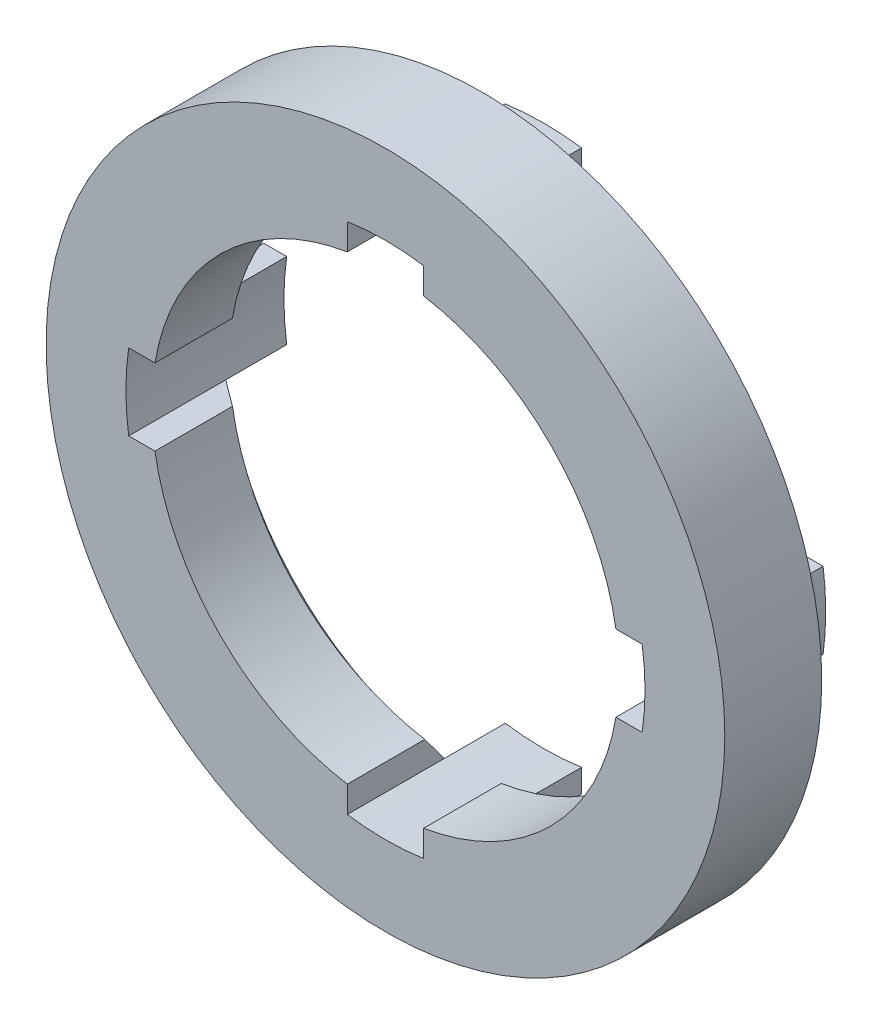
ISO-10303-21;
HEADER;
FILE_DESCRIPTION(('STEP AP214'),'2;1');
FILE_NAME('part.step','',(''),(''),'','','');
FILE_SCHEMA(('AUTOMOTIVE_DESIGN { 1 0 10303 214 1 1 1 1 }'));
ENDSEC;
DATA;
#1=APPLICATION_CONTEXT('core data for automotive mechanical design processes');
#2=APPLICATION_PROTOCOL_DEFINITION('international standard','automotive_design',2000,#1);
#3=PRODUCT_CONTEXT('',#1,'mechanical');
#4=PRODUCT('Part','Part','',(#3));
#5=PRODUCT_RELATED_PRODUCT_CATEGORY('part','',(#4));
#6=PRODUCT_DEFINITION_FORMATION('','',#4);
#7=PRODUCT_DEFINITION_CONTEXT('part definition',#1,'design');
#8=PRODUCT_DEFINITION('design','',#6,#7);
#9=PRODUCT_DEFINITION_SHAPE('','',#8);
#10=(LENGTH_UNIT() NAMED_UNIT(*) SI_UNIT(.MILLI.,.METRE.));
#11=(NAMED_UNIT(*) PLANE_ANGLE_UNIT() SI_UNIT($,.RADIAN.));
#12=(NAMED_UNIT(*) SI_UNIT($,.STERADIAN.) SOLID_ANGLE_UNIT());
#13=UNCERTAINTY_MEASURE_WITH_UNIT(LENGTH_MEASURE(1.E-05),#10,'distance_accuracy_value','');
#14=(GEOMETRIC_REPRESENTATION_CONTEXT(3) GLOBAL_UNCERTAINTY_ASSIGNED_CONTEXT((#13)) GLOBAL_UNIT_ASSIGNED_CONTEXT((#10,
#11,#12)) REPRESENTATION_CONTEXT('',''));
#15=CARTESIAN_POINT('',(0.,0.,0.));
#16=DIRECTION('',(0.,0.,1.));
#17=DIRECTION('',(1.,0.,0.));
#18=AXIS2_PLACEMENT_3D('',#15,#16,#17);
#19=CARTESIAN_POINT('',(0.,0.,0.));
#20=DIRECTION('',(0.,0.,1.));
#21=DIRECTION('',(1.,0.,0.));
#22=AXIS2_PLACEMENT_3D('',#19,#20,#21);
#23=PLANE('',#22);
#24=CARTESIAN_POINT('',(0.,0.,0.));
#25=DIRECTION('',(0.,0.,1.));
#26=DIRECTION('',(1.,0.,0.));
#27=AXIS2_PLACEMENT_3D('',#24,#25,#26);
#28=CIRCLE('',#27,22.225);
#29=CARTESIAN_POINT('',(22.225,0.,0.));
#30=VERTEX_POINT('',#29);
#31=EDGE_CURVE('E45',#30,#30,#28,.T.);
#32=ORIENTED_EDGE('',*,*,#31,.F.);
#33=EDGE_LOOP('',(#32));
#34=FACE_BOUND('',#33,.T.);
#35=DIRECTION('',(0.,-1.,0.));
#36=VECTOR('',#35,1.);
#37=CARTESIAN_POINT('',(2.50000000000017,-16.8151717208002,0.));
#38=LINE('',#37,#36);
#39=CARTESIAN_POINT('',(2.50000000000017,-16.8151717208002,0.));
#40=VERTEX_POINT('',#39);
#41=CARTESIAN_POINT('',(2.50000000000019,-18.3151717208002,0.));
#42=VERTEX_POINT('',#41);
#43=EDGE_CURVE('E932',#40,#42,#38,.T.);
#44=ORIENTED_EDGE('',*,*,#43,.F.);
#45=CARTESIAN_POINT('',(0.,0.,0.));
#46=DIRECTION('',(0.,0.,-1.));
#47=DIRECTION('',(-1.,0.,0.));
#48=AXIS2_PLACEMENT_3D('',#45,#46,#47);
#49=CIRCLE('',#48,17.);
#50=CARTESIAN_POINT('',(16.8151717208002,-2.5,0.));
#51=VERTEX_POINT('',#50);
#52=EDGE_CURVE('E527',#51,#40,#49,.T.);
#53=ORIENTED_EDGE('',*,*,#52,.F.);
#54=DIRECTION('',(-1.,0.,0.));
#55=VECTOR('',#54,1.);
#56=CARTESIAN_POINT('',(16.8151717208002,-2.5,0.));
#57=LINE('',#56,#55);
#58=CARTESIAN_POINT('',(18.3151717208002,-2.5,0.));
#59=VERTEX_POINT('',#58);
#60=EDGE_CURVE('E544',#59,#51,#57,.T.);
#61=ORIENTED_EDGE('',*,*,#60,.F.);
#62=CARTESIAN_POINT('',(0.,0.,0.));
#63=DIRECTION('',(0.,0.,-1.));
#64=DIRECTION('',(-1.,0.,0.));
#65=AXIS2_PLACEMENT_3D('',#62,#63,#64);
#66=CIRCLE('',#65,18.4850078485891);
#67=CARTESIAN_POINT('',(18.3151717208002,2.5,0.));
#68=VERTEX_POINT('',#67);
#69=EDGE_CURVE('E548',#68,#59,#66,.T.);
#70=ORIENTED_EDGE('',*,*,#69,.F.);
#71=DIRECTION('',(1.,0.,0.));
#72=VECTOR('',#71,1.);
#73=CARTESIAN_POINT('',(16.8151717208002,2.5,0.));
#74=LINE('',#73,#72);
#75=CARTESIAN_POINT('',(16.8151717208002,2.5,0.));
#76=VERTEX_POINT('',#75);
#77=EDGE_CURVE('E412',#76,#68,#74,.T.);
#78=ORIENTED_EDGE('',*,*,#77,.F.);
#79=CARTESIAN_POINT('',(2.49999999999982,16.8151717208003,0.));
#80=VERTEX_POINT('',#79);
#81=EDGE_CURVE('E39',#80,#76,#49,.T.);
#82=ORIENTED_EDGE('',*,*,#81,.F.);
#83=DIRECTION('',(0.,-1.,0.));
#84=VECTOR('',#83,1.);
#85=CARTESIAN_POINT('',(2.49999999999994,16.8151717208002,0.));
#86=LINE('',#85,#84);
#87=CARTESIAN_POINT('',(2.49999999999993,18.3151717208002,0.));
#88=VERTEX_POINT('',#87);
#89=EDGE_CURVE('E287',#88,#80,#86,.T.);
#90=ORIENTED_EDGE('',*,*,#89,.F.);
#91=CARTESIAN_POINT('',(0.,0.,0.));
#92=DIRECTION('',(0.,0.,-1.));
#93=DIRECTION('',(0.,-1.,0.));
#94=AXIS2_PLACEMENT_3D('',#91,#92,#93);
#95=CIRCLE('',#94,18.4850078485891);
#96=CARTESIAN_POINT('',(-2.50000000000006,18.3151717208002,0.));
#97=VERTEX_POINT('',#96);
#98=EDGE_CURVE('E295',#97,#88,#95,.T.);
#99=ORIENTED_EDGE('',*,*,#98,.F.);
#100=DIRECTION('',(0.,1.,0.));
#101=VECTOR('',#100,1.);
#102=CARTESIAN_POINT('',(-2.50000000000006,16.8151717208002,0.));
#103=LINE('',#102,#101);
#104=CARTESIAN_POINT('',(-2.50000000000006,16.8151717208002,0.));
#105=VERTEX_POINT('',#104);
#106=EDGE_CURVE('E282',#105,#97,#103,.T.);
#107=ORIENTED_EDGE('',*,*,#106,.F.);
#108=CARTESIAN_POINT('',(-16.8151717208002,2.5,0.));
#109=VERTEX_POINT('',#108);
#110=EDGE_CURVE('E521',#109,#105,#49,.T.);
#111=ORIENTED_EDGE('',*,*,#110,.F.);
#112=DIRECTION('',(1.,0.,0.));
#113=VECTOR('',#112,1.);
#114=CARTESIAN_POINT('',(-16.8151717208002,2.5,0.));
#115=LINE('',#114,#113);
#116=CARTESIAN_POINT('',(-18.3151717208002,2.5,0.));
#117=VERTEX_POINT('',#116);
#118=EDGE_CURVE('E263',#117,#109,#115,.T.);
#119=ORIENTED_EDGE('',*,*,#118,.F.);
#120=CARTESIAN_POINT('',(0.,0.,0.));
#121=DIRECTION('',(0.,0.,-1.));
#122=DIRECTION('',(1.,0.,0.));
#123=AXIS2_PLACEMENT_3D('',#120,#121,#122);
#124=CIRCLE('',#123,18.4850078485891);
#125=CARTESIAN_POINT('',(-18.3151717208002,-2.5,0.));
#126=VERTEX_POINT('',#125);
#127=EDGE_CURVE('E253',#126,#117,#124,.T.);
#128=ORIENTED_EDGE('',*,*,#127,.F.);
#129=DIRECTION('',(-1.,0.,0.));
#130=VECTOR('',#129,1.);
#131=CARTESIAN_POINT('',(-16.8151717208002,-2.5,0.));
#132=LINE('',#131,#130);
#133=CARTESIAN_POINT('',(-16.8151717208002,-2.5,0.));
#134=VERTEX_POINT('',#133);
#135=EDGE_CURVE('E251',#134,#126,#132,.T.);
#136=ORIENTED_EDGE('',*,*,#135,.F.);
#137=CARTESIAN_POINT('',(-2.49999999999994,-16.8151717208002,0.));
#138=VERTEX_POINT('',#137);
#139=EDGE_CURVE('E534',#138,#134,#49,.T.);
#140=ORIENTED_EDGE('',*,*,#139,.F.);
#141=DIRECTION('',(0.,1.,0.));
#142=VECTOR('',#141,1.);
#143=CARTESIAN_POINT('',(-2.49999999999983,-16.8151717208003,0.));
#144=LINE('',#143,#142);
#145=CARTESIAN_POINT('',(-2.4999999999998,-18.3151717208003,0.));
#146=VERTEX_POINT('',#145);
#147=EDGE_CURVE('E244',#146,#138,#144,.T.);
#148=ORIENTED_EDGE('',*,*,#147,.F.);
#149=CARTESIAN_POINT('',(0.,0.,0.));
#150=DIRECTION('',(0.,0.,-1.));
#151=DIRECTION('',(0.,1.,0.));
#152=AXIS2_PLACEMENT_3D('',#149,#150,#151);
#153=CIRCLE('',#152,18.4850078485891);
#154=EDGE_CURVE('E917',#42,#146,#153,.T.);
#155=ORIENTED_EDGE('',*,*,#154,.F.);
#156=EDGE_LOOP('',(#44,#53,#61,#70,#78,#82,#90,#99,#107,#111,#119,#128,#136,#140,#148,#155));
#157=FACE_BOUND('',#156,.T.);
#158=ADVANCED_FACE('F35',(#34,#157),#23,.F.);
#159=CARTESIAN_POINT('',(0.,0.,-0.00100000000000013));
#160=DIRECTION('',(0.,0.,1.));
#161=DIRECTION('',(1.,0.,0.));
#162=AXIS2_PLACEMENT_3D('',#159,#160,#161);
#163=CYLINDRICAL_SURFACE('',#162,15.3);
#164=CARTESIAN_POINT('',(0.,0.,6.35));
#165=DIRECTION('',(0.,0.,1.));
#166=DIRECTION('',(1.,0.,0.));
#167=AXIS2_PLACEMENT_3D('',#164,#165,#166);
#168=CIRCLE('',#167,15.3);
#169=CARTESIAN_POINT('',(15.0943698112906,2.5,6.35));
#170=VERTEX_POINT('',#169);
#171=CARTESIAN_POINT('',(2.49999999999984,15.0943698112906,6.35));
#172=VERTEX_POINT('',#171);
#173=EDGE_CURVE('E508',#170,#172,#168,.T.);
#174=ORIENTED_EDGE('',*,*,#173,.T.);
#175=DIRECTION('',(0.,0.,1.));
#176=VECTOR('',#175,1.);
#177=CARTESIAN_POINT('',(2.49999999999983,15.0943698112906,-0.00100000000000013));
#178=LINE('',#177,#176);
#179=CARTESIAN_POINT('',(2.49999999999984,15.0943698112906,1.27407777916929));
#180=VERTEX_POINT('',#179);
#181=EDGE_CURVE('E309',#180,#172,#178,.T.);
#182=ORIENTED_EDGE('',*,*,#181,.F.);
#183=CARTESIAN_POINT('',(0.,0.,1.27407777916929));
#184=DIRECTION('',(0.,0.,-1.));
#185=DIRECTION('',(-1.,0.,0.));
#186=AXIS2_PLACEMENT_3D('',#183,#184,#185);
#187=CIRCLE('',#186,15.3);
#188=CARTESIAN_POINT('',(15.0943698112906,2.5,1.27407777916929));
#189=VERTEX_POINT('',#188);
#190=EDGE_CURVE('E516',#180,#189,#187,.T.);
#191=ORIENTED_EDGE('',*,*,#190,.T.);
#192=DIRECTION('',(0.,0.,1.));
#193=VECTOR('',#192,1.);
#194=CARTESIAN_POINT('',(15.0943698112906,2.5,-0.00100000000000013));
#195=LINE('',#194,#193);
#196=EDGE_CURVE('E335',#170,#189,#195,.F.);
#197=ORIENTED_EDGE('',*,*,#196,.F.);
#198=EDGE_LOOP('',(#174,#182,#191,#197));
#199=FACE_BOUND('',#198,.T.);
#200=ADVANCED_FACE('F613',(#199),#163,.F.);
#201=CARTESIAN_POINT('',(0.,0.,0.));
#202=DIRECTION('',(0.,0.,-1.));
#203=DIRECTION('',(-1.,0.,0.));
#204=AXIS2_PLACEMENT_3D('',#201,#202,#203);
#205=CONICAL_SURFACE('',#204,17.,0.92764249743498);
#206=ORIENTED_EDGE('',*,*,#190,.F.);
#207=CARTESIAN_POINT('',(2.4999999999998,18.6606311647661,-1.36952213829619));
#208=CARTESIAN_POINT('',(2.49999999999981,18.1151663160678,-0.964351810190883));
#209=CARTESIAN_POINT('',(2.49999999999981,17.5695632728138,-0.55936728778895));
#210=CARTESIAN_POINT('',(2.49999999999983,16.4779615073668,0.250065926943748));
#211=CARTESIAN_POINT('',(2.49999999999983,15.9319627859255,0.654514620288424));
#212=CARTESIAN_POINT('',(2.49999999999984,14.8394477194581,1.46271393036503));
#213=CARTESIAN_POINT('',(2.49999999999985,14.292931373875,1.86646454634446));
#214=CARTESIAN_POINT('',(2.49999999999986,13.1991514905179,2.67295442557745));
#215=CARTESIAN_POINT('',(2.49999999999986,12.6518879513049,3.07569368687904));
#216=CARTESIAN_POINT('',(2.49999999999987,12.1041367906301,3.47777007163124));
#217=B_SPLINE_CURVE_WITH_KNOTS('',3,(#207,#208,#209,#210,#211,#212,#213,#214,#215,#216),
.UNSPECIFIED.,.F.,.F.,(4,2,2,2,4),(0.,2.03844417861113,4.07688449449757,6.1153270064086,
8.1537734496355),.UNSPECIFIED.);
#218=EDGE_CURVE('E311',#80,#180,#217,.T.);
#219=ORIENTED_EDGE('',*,*,#218,.F.);
#220=ORIENTED_EDGE('',*,*,#81,.T.);
#221=CARTESIAN_POINT('',(12.10413679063,2.5,3.47777007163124));
#222=CARTESIAN_POINT('',(12.6518879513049,2.5,3.07569368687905));
#223=CARTESIAN_POINT('',(13.1991514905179,2.5,2.67295442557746));
#224=CARTESIAN_POINT('',(14.2929313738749,2.5,1.86646454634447));
#225=CARTESIAN_POINT('',(14.8394477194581,2.5,1.46271393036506));
#226=CARTESIAN_POINT('',(15.9319627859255,2.5,0.654514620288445));
#227=CARTESIAN_POINT('',(16.4779615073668,2.5,0.250065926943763));
#228=CARTESIAN_POINT('',(17.5695632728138,2.5,-0.559367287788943));
#229=CARTESIAN_POINT('',(18.1151663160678,2.5,-0.964351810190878));
#230=CARTESIAN_POINT('',(18.6606311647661,2.5,-1.36952213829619));
#231=B_SPLINE_CURVE_WITH_KNOTS('',3,(#221,#222,#223,#224,#225,#226,#227,#228,#229,#230),
.UNSPECIFIED.,.F.,.F.,(4,2,2,2,4),(0.,2.03844644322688,4.07688895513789,6.11532927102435,
8.1537734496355),.UNSPECIFIED.);
#232=EDGE_CURVE('E385',#189,#76,#231,.T.);
#233=ORIENTED_EDGE('',*,*,#232,.F.);
#234=EDGE_LOOP('',(#206,#219,#220,#233));
#235=FACE_BOUND('',#234,.T.);
#236=ADVANCED_FACE('F591',(#235),#205,.F.);
#237=CARTESIAN_POINT('',(2.50000000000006,-15.0943698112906,6.35));
#238=VERTEX_POINT('',#237);
#239=CARTESIAN_POINT('',(15.0943698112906,-2.5,6.35));
#240=VERTEX_POINT('',#239);
#241=EDGE_CURVE('E502',#238,#240,#168,.T.);
#242=ORIENTED_EDGE('',*,*,#241,.T.);
#243=DIRECTION('',(0.,0.,1.));
#244=VECTOR('',#243,1.);
#245=CARTESIAN_POINT('',(15.0943698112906,-2.49999999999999,-0.00100000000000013));
#246=LINE('',#245,#244);
#247=CARTESIAN_POINT('',(15.0943698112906,-2.5,1.27407777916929));
#248=VERTEX_POINT('',#247);
#249=EDGE_CURVE('E596',#248,#240,#246,.T.);
#250=ORIENTED_EDGE('',*,*,#249,.F.);
#251=CARTESIAN_POINT('',(2.50000000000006,-15.0943698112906,1.27407777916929));
#252=VERTEX_POINT('',#251);
#253=EDGE_CURVE('E61',#248,#252,#187,.T.);
#254=ORIENTED_EDGE('',*,*,#253,.T.);
#255=DIRECTION('',(0.,0.,1.));
#256=VECTOR('',#255,1.);
#257=CARTESIAN_POINT('',(2.50000000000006,-15.0943698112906,-0.00100000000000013));
#258=LINE('',#257,#256);
#259=EDGE_CURVE('E386',#238,#252,#258,.F.);
#260=ORIENTED_EDGE('',*,*,#259,.F.);
#261=EDGE_LOOP('',(#242,#250,#254,#260));
#262=FACE_BOUND('',#261,.T.);
#263=ADVANCED_FACE('F603',(#262),#163,.F.);
#264=ORIENTED_EDGE('',*,*,#253,.F.);
#265=CARTESIAN_POINT('',(18.6606311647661,-2.5,-1.36952213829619));
#266=CARTESIAN_POINT('',(18.1151663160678,-2.5,-0.964351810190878));
#267=CARTESIAN_POINT('',(17.5695632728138,-2.5,-0.559367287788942));
#268=CARTESIAN_POINT('',(16.4779615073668,-2.5,0.250065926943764));
#269=CARTESIAN_POINT('',(15.9319627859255,-2.5,0.654514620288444));
#270=CARTESIAN_POINT('',(14.8394477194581,-2.5,1.46271393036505));
#271=CARTESIAN_POINT('',(14.2929313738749,-2.5,1.86646454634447));
#272=CARTESIAN_POINT('',(13.1991514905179,-2.5,2.67295442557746));
#273=CARTESIAN_POINT('',(12.6518879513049,-2.5,3.07569368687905));
#274=CARTESIAN_POINT('',(12.10413679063,-2.5,3.47777007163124));
#275=B_SPLINE_CURVE_WITH_KNOTS('',3,(#265,#266,#267,#268,#269,#270,#271,#272,#273,#274),
.UNSPECIFIED.,.F.,.F.,(4,2,2,2,4),(0.,2.03844417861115,4.07688449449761,6.11532700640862,
8.15377344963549),.UNSPECIFIED.);
#276=EDGE_CURVE('E369',#51,#248,#275,.T.);
#277=ORIENTED_EDGE('',*,*,#276,.F.);
#278=ORIENTED_EDGE('',*,*,#52,.T.);
#279=CARTESIAN_POINT('',(2.50000000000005,-13.2452231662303,2.63877053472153));
#280=CARTESIAN_POINT('',(2.50000000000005,-13.7923305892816,2.23582019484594));
#281=CARTESIAN_POINT('',(2.50000000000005,-14.3390582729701,1.83235507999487));
#282=CARTESIAN_POINT('',(2.50000000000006,-15.4319229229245,1.02462690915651));
#283=CARTESIAN_POINT('',(2.50000000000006,-15.978059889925,0.620363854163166));
#284=CARTESIAN_POINT('',(2.50000000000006,-17.0699128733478,-0.188729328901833));
#285=CARTESIAN_POINT('',(2.50000000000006,-17.6156288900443,-0.593559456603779));
#286=CARTESIAN_POINT('',(2.50000000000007,-18.7067341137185,-1.40366131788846));
#287=CARTESIAN_POINT('',(2.50000000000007,-19.2521233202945,-1.80893305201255));
#288=CARTESIAN_POINT('',(2.50000000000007,-19.797395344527,-2.21436222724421));
#289=B_SPLINE_CURVE_WITH_KNOTS('',3,(#279,#280,#281,#282,#283,#284,#285,#286,#287,#288),
.UNSPECIFIED.,.F.,.F.,(4,2,2,2,4),(0.,2.03844439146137,4.07688624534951,6.11532677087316,
8.15376979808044),.UNSPECIFIED.);
#290=EDGE_CURVE('E406',#252,#40,#289,.T.);
#291=ORIENTED_EDGE('',*,*,#290,.F.);
#292=EDGE_LOOP('',(#264,#277,#278,#291));
#293=FACE_BOUND('',#292,.T.);
#294=ADVANCED_FACE('F606',(#293),#205,.F.);
#295=CARTESIAN_POINT('',(-15.0943698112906,-2.5,6.35));
#296=VERTEX_POINT('',#295);
#297=CARTESIAN_POINT('',(-2.49999999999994,-15.0943698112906,6.35));
#298=VERTEX_POINT('',#297);
#299=EDGE_CURVE('E496',#296,#298,#168,.T.);
#300=ORIENTED_EDGE('',*,*,#299,.T.);
#301=DIRECTION('',(0.,0.,1.));
#302=VECTOR('',#301,1.);
#303=CARTESIAN_POINT('',(-2.49999999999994,-15.0943698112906,-0.00100000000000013));
#304=LINE('',#303,#302);
#305=CARTESIAN_POINT('',(-2.49999999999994,-15.0943698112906,1.27407777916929));
#306=VERTEX_POINT('',#305);
#307=EDGE_CURVE('E388',#306,#298,#304,.T.);
#308=ORIENTED_EDGE('',*,*,#307,.F.);
#309=CARTESIAN_POINT('',(-15.0943698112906,-2.5,1.27407777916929));
#310=VERTEX_POINT('',#309);
#311=EDGE_CURVE('E518',#306,#310,#187,.T.);
#312=ORIENTED_EDGE('',*,*,#311,.T.);
#313=DIRECTION('',(0.,0.,1.));
#314=VECTOR('',#313,1.);
#315=CARTESIAN_POINT('',(-15.0943698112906,-2.5,-0.00100000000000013));
#316=LINE('',#315,#314);
#317=EDGE_CURVE('E560',#296,#310,#316,.F.);
#318=ORIENTED_EDGE('',*,*,#317,.F.);
#319=EDGE_LOOP('',(#300,#308,#312,#318));
#320=FACE_BOUND('',#319,.T.);
#321=ADVANCED_FACE('F660',(#320),#163,.F.);
#322=ORIENTED_EDGE('',*,*,#311,.F.);
#323=CARTESIAN_POINT('',(-2.49999999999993,-19.797395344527,-2.21436222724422));
#324=CARTESIAN_POINT('',(-2.49999999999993,-19.2521233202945,-1.80893305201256));
#325=CARTESIAN_POINT('',(-2.49999999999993,-18.7067341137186,-1.40366131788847));
#326=CARTESIAN_POINT('',(-2.49999999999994,-17.6156288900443,-0.593559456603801));
#327=CARTESIAN_POINT('',(-2.49999999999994,-17.0699128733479,-0.18872932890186));
#328=CARTESIAN_POINT('',(-2.49999999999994,-15.9780598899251,0.620363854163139));
#329=CARTESIAN_POINT('',(-2.49999999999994,-15.4319229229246,1.02462690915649));
#330=CARTESIAN_POINT('',(-2.49999999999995,-14.3390582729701,1.83235507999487));
#331=CARTESIAN_POINT('',(-2.49999999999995,-13.7923305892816,2.23582019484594));
#332=CARTESIAN_POINT('',(-2.49999999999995,-13.2452231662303,2.63877053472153));
#333=B_SPLINE_CURVE_WITH_KNOTS('',3,(#323,#324,#325,#326,#327,#328,#329,#330,#331,#332),
.UNSPECIFIED.,.F.,.F.,(4,2,2,2,4),(0.,2.03844302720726,4.0768835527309,6.11532540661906,
8.15376979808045),.UNSPECIFIED.);
#334=EDGE_CURVE('E390',#138,#306,#333,.T.);
#335=ORIENTED_EDGE('',*,*,#334,.F.);
#336=ORIENTED_EDGE('',*,*,#139,.T.);
#337=CARTESIAN_POINT('',(-13.245231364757,-2.5,2.63876449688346));
#338=CARTESIAN_POINT('',(-13.7923344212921,-2.5,2.23581736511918));
#339=CARTESIAN_POINT('',(-14.3390577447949,-2.5,1.83235546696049));
#340=CARTESIAN_POINT('',(-15.4319136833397,-2.5,1.02463374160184));
#341=CARTESIAN_POINT('',(-15.9780462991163,-2.5,0.620373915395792));
#342=CARTESIAN_POINT('',(-17.0698905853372,-2.5,-0.188712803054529));
#343=CARTESIAN_POINT('',(-17.6156022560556,-2.5,-0.593539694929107));
#344=CARTESIAN_POINT('',(-18.7066987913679,-2.5,-1.40363507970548));
#345=CARTESIAN_POINT('',(-19.2520836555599,-2.5,-1.80890357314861));
#346=CARTESIAN_POINT('',(-19.7973513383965,-2.5,-2.21432950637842));
#347=B_SPLINE_CURVE_WITH_KNOTS('',3,(#337,#338,#339,#340,#341,#342,#343,#344,#345,#346),
.UNSPECIFIED.,.F.,.F.,(4,2,2,2,4),(0.,2.03842813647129,4.07685373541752,6.11527800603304,
8.15370477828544),.UNSPECIFIED.);
#348=EDGE_CURVE('E452',#310,#134,#347,.T.);
#349=ORIENTED_EDGE('',*,*,#348,.F.);
#350=EDGE_LOOP('',(#322,#335,#336,#349));
#351=FACE_BOUND('',#350,.T.);
#352=ADVANCED_FACE('F663',(#351),#205,.F.);
#353=CARTESIAN_POINT('',(0.,0.,6.35));
#354=DIRECTION('',(0.,0.,-1.));
#355=DIRECTION('',(-1.,0.,0.));
#356=AXIS2_PLACEMENT_3D('',#353,#354,#355);
#357=CYLINDRICAL_SURFACE('',#356,22.225);
#358=CARTESIAN_POINT('',(0.,0.,6.35));
#359=DIRECTION('',(0.,0.,1.));
#360=DIRECTION('',(1.,0.,0.));
#361=AXIS2_PLACEMENT_3D('',#358,#359,#360);
#362=CIRCLE('',#361,22.225);
#363=CARTESIAN_POINT('',(22.225,0.,6.35));
#364=VERTEX_POINT('',#363);
#365=EDGE_CURVE('E11',#364,#364,#362,.T.);
#366=ORIENTED_EDGE('',*,*,#365,.F.);
#367=EDGE_LOOP('',(#366));
#368=FACE_BOUND('',#367,.T.);
#369=ORIENTED_EDGE('',*,*,#31,.T.);
#370=EDGE_LOOP('',(#369));
#371=FACE_BOUND('',#370,.T.);
#372=ADVANCED_FACE('F37',(#368,#371),#357,.T.);
#373=CARTESIAN_POINT('',(0.,0.,6.35));
#374=DIRECTION('',(0.,0.,1.));
#375=DIRECTION('',(1.,0.,0.));
#376=AXIS2_PLACEMENT_3D('',#373,#374,#375);
#377=PLANE('',#376);
#378=DIRECTION('',(0.,1.,0.));
#379=VECTOR('',#378,1.);
#380=CARTESIAN_POINT('',(2.49999999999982,16.8151717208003,6.35));
#381=LINE('',#380,#379);
#382=CARTESIAN_POINT('',(2.49999999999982,16.8151717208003,6.35));
#383=VERTEX_POINT('',#382);
#384=EDGE_CURVE('E611',#172,#383,#381,.T.);
#385=ORIENTED_EDGE('',*,*,#384,.F.);
#386=ORIENTED_EDGE('',*,*,#173,.F.);
#387=DIRECTION('',(-1.,0.,0.));
#388=VECTOR('',#387,1.);
#389=CARTESIAN_POINT('',(16.8151717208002,2.5,6.35));
#390=LINE('',#389,#388);
#391=CARTESIAN_POINT('',(16.8151717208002,2.5,6.35));
#392=VERTEX_POINT('',#391);
#393=EDGE_CURVE('E373',#392,#170,#390,.T.);
#394=ORIENTED_EDGE('',*,*,#393,.F.);
#395=CARTESIAN_POINT('',(0.,0.,6.35));
#396=DIRECTION('',(0.,0.,1.));
#397=DIRECTION('',(-1.,0.,0.));
#398=AXIS2_PLACEMENT_3D('',#395,#396,#397);
#399=CIRCLE('',#398,17.);
#400=CARTESIAN_POINT('',(16.8151717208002,-2.5,6.35));
#401=VERTEX_POINT('',#400);
#402=EDGE_CURVE('E370',#401,#392,#399,.T.);
#403=ORIENTED_EDGE('',*,*,#402,.F.);
#404=DIRECTION('',(1.,0.,0.));
#405=VECTOR('',#404,1.);
#406=CARTESIAN_POINT('',(16.8151717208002,-2.5,6.35));
#407=LINE('',#406,#405);
#408=EDGE_CURVE('E375',#240,#401,#407,.T.);
#409=ORIENTED_EDGE('',*,*,#408,.F.);
#410=ORIENTED_EDGE('',*,*,#241,.F.);
#411=DIRECTION('',(0.,1.,0.));
#412=VECTOR('',#411,1.);
#413=CARTESIAN_POINT('',(2.50000000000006,-16.8151717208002,6.35));
#414=LINE('',#413,#412);
#415=CARTESIAN_POINT('',(2.50000000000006,-16.8151717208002,6.35));
#416=VERTEX_POINT('',#415);
#417=EDGE_CURVE('E608',#416,#238,#414,.T.);
#418=ORIENTED_EDGE('',*,*,#417,.F.);
#419=CARTESIAN_POINT('',(0.,0.,6.35));
#420=DIRECTION('',(0.,0.,1.));
#421=DIRECTION('',(0.,1.,0.));
#422=AXIS2_PLACEMENT_3D('',#419,#420,#421);
#423=CIRCLE('',#422,17.);
#424=CARTESIAN_POINT('',(-2.49999999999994,-16.8151717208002,6.35));
#425=VERTEX_POINT('',#424);
#426=EDGE_CURVE('E397',#425,#416,#423,.T.);
#427=ORIENTED_EDGE('',*,*,#426,.F.);
#428=DIRECTION('',(0.,-1.,0.));
#429=VECTOR('',#428,1.);
#430=CARTESIAN_POINT('',(-2.49999999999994,-16.8151717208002,6.35));
#431=LINE('',#430,#429);
#432=EDGE_CURVE('E499',#298,#425,#431,.T.);
#433=ORIENTED_EDGE('',*,*,#432,.F.);
#434=ORIENTED_EDGE('',*,*,#299,.F.);
#435=DIRECTION('',(1.,0.,0.));
#436=VECTOR('',#435,1.);
#437=CARTESIAN_POINT('',(-16.8151717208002,-2.5,6.35));
#438=LINE('',#437,#436);
#439=CARTESIAN_POINT('',(-16.8151717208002,-2.5,6.35));
#440=VERTEX_POINT('',#439);
#441=EDGE_CURVE('E469',#440,#296,#438,.T.);
#442=ORIENTED_EDGE('',*,*,#441,.F.);
#443=CARTESIAN_POINT('',(0.,0.,6.35));
#444=DIRECTION('',(0.,0.,1.));
#445=DIRECTION('',(1.,0.,0.));
#446=AXIS2_PLACEMENT_3D('',#443,#444,#445);
#447=CIRCLE('',#446,17.);
#448=CARTESIAN_POINT('',(-16.8151717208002,2.5,6.35));
#449=VERTEX_POINT('',#448);
#450=EDGE_CURVE('E464',#449,#440,#447,.T.);
#451=ORIENTED_EDGE('',*,*,#450,.F.);
#452=DIRECTION('',(-1.,0.,0.));
#453=VECTOR('',#452,1.);
#454=CARTESIAN_POINT('',(-16.8151717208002,2.5,6.35));
#455=LINE('',#454,#453);
#456=CARTESIAN_POINT('',(-15.0943698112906,2.5,6.35));
#457=VERTEX_POINT('',#456);
#458=EDGE_CURVE('E471',#457,#449,#455,.T.);
#459=ORIENTED_EDGE('',*,*,#458,.F.);
#460=CARTESIAN_POINT('',(-2.50000000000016,15.0943698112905,6.35));
#461=VERTEX_POINT('',#460);
#462=EDGE_CURVE('E504',#461,#457,#168,.T.);
#463=ORIENTED_EDGE('',*,*,#462,.F.);
#464=DIRECTION('',(0.,-1.,0.));
#465=VECTOR('',#464,1.);
#466=CARTESIAN_POINT('',(-2.50000000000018,16.8151717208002,6.35));
#467=LINE('',#466,#465);
#468=CARTESIAN_POINT('',(-2.50000000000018,16.8151717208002,6.35));
#469=VERTEX_POINT('',#468);
#470=EDGE_CURVE('E618',#469,#461,#467,.T.);
#471=ORIENTED_EDGE('',*,*,#470,.F.);
#472=CARTESIAN_POINT('',(0.,0.,6.35));
#473=DIRECTION('',(0.,0.,1.));
#474=DIRECTION('',(0.,-1.,0.));
#475=AXIS2_PLACEMENT_3D('',#472,#473,#474);
#476=CIRCLE('',#475,17.);
#477=EDGE_CURVE('E318',#383,#469,#476,.T.);
#478=ORIENTED_EDGE('',*,*,#477,.F.);
#479=EDGE_LOOP('',(#385,#386,#394,#403,#409,#410,#418,#427,#433,#434,#442,#451,#459,#463,#471,#478));
#480=FACE_BOUND('',#479,.T.);
#481=ORIENTED_EDGE('',*,*,#365,.T.);
#482=EDGE_LOOP('',(#481));
#483=FACE_BOUND('',#482,.T.);
#484=ADVANCED_FACE('F492',(#480,#483),#377,.T.);
#485=CARTESIAN_POINT('',(-15.0943698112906,2.5,1.27407777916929));
#486=VERTEX_POINT('',#485);
#487=CARTESIAN_POINT('',(-2.50000000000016,15.0943698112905,1.27407777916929));
#488=VERTEX_POINT('',#487);
#489=EDGE_CURVE('E509',#486,#488,#187,.T.);
#490=ORIENTED_EDGE('',*,*,#489,.T.);
#491=DIRECTION('',(0.,0.,1.));
#492=VECTOR('',#491,1.);
#493=CARTESIAN_POINT('',(-2.50000000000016,15.0943698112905,-0.00100000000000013));
#494=LINE('',#493,#492);
#495=EDGE_CURVE('E53',#461,#488,#494,.F.);
#496=ORIENTED_EDGE('',*,*,#495,.F.);
#497=ORIENTED_EDGE('',*,*,#462,.T.);
#498=DIRECTION('',(0.,0.,1.));
#499=VECTOR('',#498,1.);
#500=CARTESIAN_POINT('',(-15.0943698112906,2.49999999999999,-0.00100000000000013));
#501=LINE('',#500,#499);
#502=EDGE_CURVE('E465',#486,#457,#501,.T.);
#503=ORIENTED_EDGE('',*,*,#502,.F.);
#504=EDGE_LOOP('',(#490,#496,#497,#503));
#505=FACE_BOUND('',#504,.T.);
#506=ADVANCED_FACE('F623',(#505),#163,.F.);
#507=ORIENTED_EDGE('',*,*,#110,.T.);
#508=CARTESIAN_POINT('',(-2.50000000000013,12.10413679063,3.47777007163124));
#509=CARTESIAN_POINT('',(-2.50000000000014,12.6518879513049,3.07569368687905));
#510=CARTESIAN_POINT('',(-2.50000000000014,13.1991514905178,2.67295442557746));
#511=CARTESIAN_POINT('',(-2.50000000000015,14.2929313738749,1.86646454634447));
#512=CARTESIAN_POINT('',(-2.50000000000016,14.8394477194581,1.46271393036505));
#513=CARTESIAN_POINT('',(-2.50000000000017,15.9319627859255,0.654514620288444));
#514=CARTESIAN_POINT('',(-2.50000000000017,16.4779615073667,0.250065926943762));
#515=CARTESIAN_POINT('',(-2.50000000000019,17.5695632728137,-0.559367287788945));
#516=CARTESIAN_POINT('',(-2.50000000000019,18.1151663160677,-0.96435181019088));
#517=CARTESIAN_POINT('',(-2.5000000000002,18.6606311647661,-1.36952213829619));
#518=B_SPLINE_CURVE_WITH_KNOTS('',3,(#508,#509,#510,#511,#512,#513,#514,#515,#516,#517),
.UNSPECIFIED.,.F.,.F.,(4,2,2,2,4),(0.,2.03844644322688,4.07688895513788,6.11532927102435,
8.1537734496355),.UNSPECIFIED.);
#519=EDGE_CURVE('E329',#488,#105,#518,.T.);
#520=ORIENTED_EDGE('',*,*,#519,.F.);
#521=ORIENTED_EDGE('',*,*,#489,.F.);
#522=CARTESIAN_POINT('',(-19.7973513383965,2.5,-2.21432950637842));
#523=CARTESIAN_POINT('',(-19.2520836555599,2.5,-1.80890357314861));
#524=CARTESIAN_POINT('',(-18.7066987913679,2.5,-1.40363507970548));
#525=CARTESIAN_POINT('',(-17.6156022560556,2.5,-0.593539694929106));
#526=CARTESIAN_POINT('',(-17.0698905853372,2.5,-0.188712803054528));
#527=CARTESIAN_POINT('',(-15.9780462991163,2.5,0.620373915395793));
#528=CARTESIAN_POINT('',(-15.4319136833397,2.5,1.02463374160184));
#529=CARTESIAN_POINT('',(-14.3390577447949,2.5,1.83235546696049));
#530=CARTESIAN_POINT('',(-13.7923344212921,2.5,2.23581736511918));
#531=CARTESIAN_POINT('',(-13.245231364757,2.5,2.63876449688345));
#532=B_SPLINE_CURVE_WITH_KNOTS('',3,(#522,#523,#524,#525,#526,#527,#528,#529,#530,#531),
.UNSPECIFIED.,.F.,.F.,(4,2,2,2,4),(0.,2.0384267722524,4.07685104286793,6.11527664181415,
8.15370477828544),.UNSPECIFIED.);
#533=EDGE_CURVE('E458',#109,#486,#532,.T.);
#534=ORIENTED_EDGE('',*,*,#533,.F.);
#535=EDGE_LOOP('',(#507,#520,#521,#534));
#536=FACE_BOUND('',#535,.T.);
#537=ADVANCED_FACE('F624',(#536),#205,.F.);
#538=CARTESIAN_POINT('',(0.,0.,-0.00100000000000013));
#539=DIRECTION('',(0.,0.,1.));
#540=DIRECTION('',(1.,0.,0.));
#541=AXIS2_PLACEMENT_3D('',#538,#539,#540);
#542=CYLINDRICAL_SURFACE('',#541,17.);
#543=DIRECTION('',(0.,0.,1.));
#544=VECTOR('',#543,1.);
#545=CARTESIAN_POINT('',(-16.8151717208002,-2.5,-0.00100000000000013));
#546=LINE('',#545,#544);
#547=EDGE_CURVE('E474',#134,#440,#546,.T.);
#548=ORIENTED_EDGE('',*,*,#547,.F.);
#549=DIRECTION('',(0.,0.,1.));
#550=VECTOR('',#549,1.);
#551=CARTESIAN_POINT('',(-16.8151717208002,-2.5,-4.));
#552=LINE('',#551,#550);
#553=CARTESIAN_POINT('',(-16.8151717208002,-2.5,-4.));
#554=VERTEX_POINT('',#553);
#555=EDGE_CURVE('E280',#554,#134,#552,.T.);
#556=ORIENTED_EDGE('',*,*,#555,.F.);
#557=CARTESIAN_POINT('',(0.,0.,-4.));
#558=DIRECTION('',(0.,0.,1.));
#559=DIRECTION('',(1.,0.,0.));
#560=AXIS2_PLACEMENT_3D('',#557,#558,#559);
#561=CIRCLE('',#560,17.);
#562=CARTESIAN_POINT('',(-16.8151717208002,2.5,-4.));
#563=VERTEX_POINT('',#562);
#564=EDGE_CURVE('E259',#563,#554,#561,.T.);
#565=ORIENTED_EDGE('',*,*,#564,.F.);
#566=DIRECTION('',(0.,0.,1.));
#567=VECTOR('',#566,1.);
#568=CARTESIAN_POINT('',(-16.8151717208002,2.5,-4.));
#569=LINE('',#568,#567);
#570=EDGE_CURVE('E268',#563,#109,#569,.T.);
#571=ORIENTED_EDGE('',*,*,#570,.T.);
#572=DIRECTION('',(0.,0.,1.));
#573=VECTOR('',#572,1.);
#574=CARTESIAN_POINT('',(-16.8151717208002,2.5,-0.00100000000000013));
#575=LINE('',#574,#573);
#576=EDGE_CURVE('E475',#109,#449,#575,.T.);
#577=ORIENTED_EDGE('',*,*,#576,.T.);
#578=ORIENTED_EDGE('',*,*,#450,.T.);
#579=EDGE_LOOP('',(#548,#556,#565,#571,#577,#578));
#580=FACE_BOUND('',#579,.T.);
#581=ADVANCED_FACE('F486',(#580),#542,.F.);
#582=CARTESIAN_POINT('',(-16.8151717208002,2.5,-0.00100000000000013));
#583=DIRECTION('',(0.,1.,0.));
#584=DIRECTION('',(0.,0.,1.));
#585=AXIS2_PLACEMENT_3D('',#582,#583,#584);
#586=PLANE('',#585);
#587=ORIENTED_EDGE('',*,*,#533,.T.);
#588=ORIENTED_EDGE('',*,*,#502,.T.);
#589=ORIENTED_EDGE('',*,*,#458,.T.);
#590=ORIENTED_EDGE('',*,*,#576,.F.);
#591=EDGE_LOOP('',(#587,#588,#589,#590));
#592=FACE_BOUND('',#591,.T.);
#593=ADVANCED_FACE('F447',(#592),#586,.F.);
#594=CARTESIAN_POINT('',(-16.8151717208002,-2.5,-0.00100000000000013));
#595=DIRECTION('',(0.,-1.,0.));
#596=DIRECTION('',(0.,0.,-1.));
#597=AXIS2_PLACEMENT_3D('',#594,#595,#596);
#598=PLANE('',#597);
#599=ORIENTED_EDGE('',*,*,#348,.T.);
#600=ORIENTED_EDGE('',*,*,#547,.T.);
#601=ORIENTED_EDGE('',*,*,#441,.T.);
#602=ORIENTED_EDGE('',*,*,#317,.T.);
#603=EDGE_LOOP('',(#599,#600,#601,#602));
#604=FACE_BOUND('',#603,.T.);
#605=ADVANCED_FACE('F443',(#604),#598,.F.);
#606=CARTESIAN_POINT('',(0.,0.,-4.));
#607=DIRECTION('',(0.,0.,1.));
#608=DIRECTION('',(1.,0.,0.));
#609=AXIS2_PLACEMENT_3D('',#606,#607,#608);
#610=CYLINDRICAL_SURFACE('',#609,17.);
#611=DIRECTION('',(0.,0.,1.));
#612=VECTOR('',#611,1.);
#613=CARTESIAN_POINT('',(16.8151717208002,-2.5,-4.));
#614=LINE('',#613,#612);
#615=CARTESIAN_POINT('',(16.8151717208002,-2.5,-4.));
#616=VERTEX_POINT('',#615);
#617=EDGE_CURVE('E539',#616,#51,#614,.T.);
#618=ORIENTED_EDGE('',*,*,#617,.T.);
#619=DIRECTION('',(0.,0.,1.));
#620=VECTOR('',#619,1.);
#621=CARTESIAN_POINT('',(16.8151717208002,-2.5,-4.001025));
#622=LINE('',#621,#620);
#623=EDGE_CURVE('E383',#51,#401,#622,.T.);
#624=ORIENTED_EDGE('',*,*,#623,.T.);
#625=ORIENTED_EDGE('',*,*,#402,.T.);
#626=DIRECTION('',(0.,0.,1.));
#627=VECTOR('',#626,1.);
#628=CARTESIAN_POINT('',(16.8151717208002,2.5,-4.001025));
#629=LINE('',#628,#627);
#630=EDGE_CURVE('E378',#76,#392,#629,.T.);
#631=ORIENTED_EDGE('',*,*,#630,.F.);
#632=DIRECTION('',(0.,0.,1.));
#633=VECTOR('',#632,1.);
#634=CARTESIAN_POINT('',(16.8151717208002,2.5,-4.));
#635=LINE('',#634,#633);
#636=CARTESIAN_POINT('',(16.8151717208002,2.5,-4.));
#637=VERTEX_POINT('',#636);
#638=EDGE_CURVE('E559',#637,#76,#635,.T.);
#639=ORIENTED_EDGE('',*,*,#638,.F.);
#640=CARTESIAN_POINT('',(0.,0.,-4.));
#641=DIRECTION('',(0.,0.,1.));
#642=DIRECTION('',(-1.,0.,0.));
#643=AXIS2_PLACEMENT_3D('',#640,#641,#642);
#644=CIRCLE('',#643,17.);
#645=EDGE_CURVE('E415',#616,#637,#644,.T.);
#646=ORIENTED_EDGE('',*,*,#645,.F.);
#647=EDGE_LOOP('',(#618,#624,#625,#631,#639,#646));
#648=FACE_BOUND('',#647,.T.);
#649=ADVANCED_FACE('F439',(#648),#610,.F.);
#650=CARTESIAN_POINT('',(16.8151717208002,2.5,-4.));
#651=DIRECTION('',(0.,-1.,0.));
#652=DIRECTION('',(1.,0.,0.));
#653=AXIS2_PLACEMENT_3D('',#650,#651,#652);
#654=PLANE('',#653);
#655=ORIENTED_EDGE('',*,*,#77,.T.);
#656=DIRECTION('',(0.,0.,1.));
#657=VECTOR('',#656,1.);
#658=CARTESIAN_POINT('',(18.3151717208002,2.5,-4.));
#659=LINE('',#658,#657);
#660=CARTESIAN_POINT('',(18.3151717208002,2.5,-4.));
#661=VERTEX_POINT('',#660);
#662=EDGE_CURVE('E557',#661,#68,#659,.T.);
#663=ORIENTED_EDGE('',*,*,#662,.F.);
#664=DIRECTION('',(1.,0.,0.));
#665=VECTOR('',#664,1.);
#666=CARTESIAN_POINT('',(16.8151717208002,2.5,-4.));
#667=LINE('',#666,#665);
#668=EDGE_CURVE('E577',#637,#661,#667,.T.);
#669=ORIENTED_EDGE('',*,*,#668,.F.);
#670=ORIENTED_EDGE('',*,*,#638,.T.);
#671=EDGE_LOOP('',(#655,#663,#669,#670));
#672=FACE_BOUND('',#671,.T.);
#673=ADVANCED_FACE('F435',(#672),#654,.F.);
#674=CARTESIAN_POINT('',(0.,0.,-4.));
#675=DIRECTION('',(0.,0.,1.));
#676=DIRECTION('',(1.,0.,0.));
#677=AXIS2_PLACEMENT_3D('',#674,#675,#676);
#678=CYLINDRICAL_SURFACE('',#677,18.4850078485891);
#679=ORIENTED_EDGE('',*,*,#69,.T.);
#680=DIRECTION('',(0.,0.,1.));
#681=VECTOR('',#680,1.);
#682=CARTESIAN_POINT('',(18.3151717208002,-2.5,-4.));
#683=LINE('',#682,#681);
#684=CARTESIAN_POINT('',(18.3151717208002,-2.5,-4.));
#685=VERTEX_POINT('',#684);
#686=EDGE_CURVE('E542',#685,#59,#683,.T.);
#687=ORIENTED_EDGE('',*,*,#686,.F.);
#688=CARTESIAN_POINT('',(0.,0.,-4.));
#689=DIRECTION('',(0.,0.,-1.));
#690=DIRECTION('',(-1.,0.,0.));
#691=AXIS2_PLACEMENT_3D('',#688,#689,#690);
#692=CIRCLE('',#691,18.4850078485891);
#693=EDGE_CURVE('E576',#661,#685,#692,.T.);
#694=ORIENTED_EDGE('',*,*,#693,.F.);
#695=ORIENTED_EDGE('',*,*,#662,.T.);
#696=EDGE_LOOP('',(#679,#687,#694,#695));
#697=FACE_BOUND('',#696,.T.);
#698=ADVANCED_FACE('F431',(#697),#678,.T.);
#699=CARTESIAN_POINT('',(16.8151717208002,-2.5,-4.));
#700=DIRECTION('',(0.,1.,0.));
#701=DIRECTION('',(-1.,0.,0.));
#702=AXIS2_PLACEMENT_3D('',#699,#700,#701);
#703=PLANE('',#702);
#704=ORIENTED_EDGE('',*,*,#60,.T.);
#705=ORIENTED_EDGE('',*,*,#617,.F.);
#706=DIRECTION('',(-1.,0.,0.));
#707=VECTOR('',#706,1.);
#708=CARTESIAN_POINT('',(16.8151717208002,-2.5,-4.));
#709=LINE('',#708,#707);
#710=EDGE_CURVE('E543',#685,#616,#709,.T.);
#711=ORIENTED_EDGE('',*,*,#710,.F.);
#712=ORIENTED_EDGE('',*,*,#686,.T.);
#713=EDGE_LOOP('',(#704,#705,#711,#712));
#714=FACE_BOUND('',#713,.T.);
#715=ADVANCED_FACE('F427',(#714),#703,.F.);
#716=CARTESIAN_POINT('',(0.,0.,-4.));
#717=DIRECTION('',(0.,0.,-1.));
#718=DIRECTION('',(-1.,0.,0.));
#719=AXIS2_PLACEMENT_3D('',#716,#717,#718);
#720=PLANE('',#719);
#721=ORIENTED_EDGE('',*,*,#645,.T.);
#722=ORIENTED_EDGE('',*,*,#668,.T.);
#723=ORIENTED_EDGE('',*,*,#693,.T.);
#724=ORIENTED_EDGE('',*,*,#710,.T.);
#725=EDGE_LOOP('',(#721,#722,#723,#724));
#726=FACE_BOUND('',#725,.T.);
#727=ADVANCED_FACE('F424',(#726),#720,.T.);
#728=CARTESIAN_POINT('',(0.,0.,-4.001025));
#729=DIRECTION('',(0.,0.,1.));
#730=DIRECTION('',(1.,0.,0.));
#731=AXIS2_PLACEMENT_3D('',#728,#729,#730);
#732=CYLINDRICAL_SURFACE('',#731,17.);
#733=DIRECTION('',(0.,0.,1.));
#734=VECTOR('',#733,1.);
#735=CARTESIAN_POINT('',(2.50000000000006,-16.8151717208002,-4.001025));
#736=LINE('',#735,#734);
#737=EDGE_CURVE('E249',#40,#416,#736,.T.);
#738=ORIENTED_EDGE('',*,*,#737,.F.);
#739=DIRECTION('',(0.,0.,1.));
#740=VECTOR('',#739,1.);
#741=CARTESIAN_POINT('',(2.50000000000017,-16.8151717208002,-4.));
#742=LINE('',#741,#740);
#743=CARTESIAN_POINT('',(2.50000000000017,-16.8151717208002,-4.));
#744=VERTEX_POINT('',#743);
#745=EDGE_CURVE('E229',#744,#40,#742,.T.);
#746=ORIENTED_EDGE('',*,*,#745,.F.);
#747=CARTESIAN_POINT('',(0.,0.,-4.));
#748=DIRECTION('',(0.,0.,1.));
#749=DIRECTION('',(0.,1.,0.));
#750=AXIS2_PLACEMENT_3D('',#747,#748,#749);
#751=CIRCLE('',#750,17.);
#752=CARTESIAN_POINT('',(-2.49999999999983,-16.8151717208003,-4.));
#753=VERTEX_POINT('',#752);
#754=EDGE_CURVE('E236',#753,#744,#751,.T.);
#755=ORIENTED_EDGE('',*,*,#754,.F.);
#756=DIRECTION('',(0.,0.,1.));
#757=VECTOR('',#756,1.);
#758=CARTESIAN_POINT('',(-2.49999999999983,-16.8151717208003,-4.));
#759=LINE('',#758,#757);
#760=EDGE_CURVE('E913',#753,#138,#759,.T.);
#761=ORIENTED_EDGE('',*,*,#760,.T.);
#762=DIRECTION('',(0.,0.,1.));
#763=VECTOR('',#762,1.);
#764=CARTESIAN_POINT('',(-2.49999999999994,-16.8151717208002,-4.001025));
#765=LINE('',#764,#763);
#766=EDGE_CURVE('E413',#138,#425,#765,.T.);
#767=ORIENTED_EDGE('',*,*,#766,.T.);
#768=ORIENTED_EDGE('',*,*,#426,.T.);
#769=EDGE_LOOP('',(#738,#746,#755,#761,#767,#768));
#770=FACE_BOUND('',#769,.T.);
#771=ADVANCED_FACE('F247',(#770),#732,.F.);
#772=CARTESIAN_POINT('',(-2.49999999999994,-16.8151717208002,-4.001025));
#773=DIRECTION('',(-1.,0.,0.));
#774=DIRECTION('',(0.,-1.,0.));
#775=AXIS2_PLACEMENT_3D('',#772,#773,#774);
#776=PLANE('',#775);
#777=ORIENTED_EDGE('',*,*,#334,.T.);
#778=ORIENTED_EDGE('',*,*,#307,.T.);
#779=ORIENTED_EDGE('',*,*,#432,.T.);
#780=ORIENTED_EDGE('',*,*,#766,.F.);
#781=EDGE_LOOP('',(#777,#778,#779,#780));
#782=FACE_BOUND('',#781,.T.);
#783=ADVANCED_FACE('F399',(#782),#776,.F.);
#784=CARTESIAN_POINT('',(2.50000000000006,-16.8151717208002,-4.001025));
#785=DIRECTION('',(1.,0.,0.));
#786=DIRECTION('',(0.,1.,0.));
#787=AXIS2_PLACEMENT_3D('',#784,#785,#786);
#788=PLANE('',#787);
#789=ORIENTED_EDGE('',*,*,#290,.T.);
#790=ORIENTED_EDGE('',*,*,#737,.T.);
#791=ORIENTED_EDGE('',*,*,#417,.T.);
#792=ORIENTED_EDGE('',*,*,#259,.T.);
#793=EDGE_LOOP('',(#789,#790,#791,#792));
#794=FACE_BOUND('',#793,.T.);
#795=ADVANCED_FACE('F417',(#794),#788,.F.);
#796=CARTESIAN_POINT('',(16.8151717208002,-2.5,-4.001025));
#797=DIRECTION('',(0.,-1.,0.));
#798=DIRECTION('',(0.,0.,-1.));
#799=AXIS2_PLACEMENT_3D('',#796,#797,#798);
#800=PLANE('',#799);
#801=ORIENTED_EDGE('',*,*,#276,.T.);
#802=ORIENTED_EDGE('',*,*,#249,.T.);
#803=ORIENTED_EDGE('',*,*,#408,.T.);
#804=ORIENTED_EDGE('',*,*,#623,.F.);
#805=EDGE_LOOP('',(#801,#802,#803,#804));
#806=FACE_BOUND('',#805,.T.);
#807=ADVANCED_FACE('F351',(#806),#800,.F.);
#808=CARTESIAN_POINT('',(16.8151717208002,2.5,-4.001025));
#809=DIRECTION('',(0.,1.,0.));
#810=DIRECTION('',(0.,0.,1.));
#811=AXIS2_PLACEMENT_3D('',#808,#809,#810);
#812=PLANE('',#811);
#813=ORIENTED_EDGE('',*,*,#232,.T.);
#814=ORIENTED_EDGE('',*,*,#630,.T.);
#815=ORIENTED_EDGE('',*,*,#393,.T.);
#816=ORIENTED_EDGE('',*,*,#196,.T.);
#817=EDGE_LOOP('',(#813,#814,#815,#816));
#818=FACE_BOUND('',#817,.T.);
#819=ADVANCED_FACE('F347',(#818),#812,.F.);
#820=CARTESIAN_POINT('',(0.,0.,-4.001025));
#821=DIRECTION('',(0.,0.,1.));
#822=DIRECTION('',(1.,0.,0.));
#823=AXIS2_PLACEMENT_3D('',#820,#821,#822);
#824=CYLINDRICAL_SURFACE('',#823,17.);
#825=DIRECTION('',(0.,0.,1.));
#826=VECTOR('',#825,1.);
#827=CARTESIAN_POINT('',(-2.50000000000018,16.8151717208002,-4.001025));
#828=LINE('',#827,#826);
#829=EDGE_CURVE('E337',#105,#469,#828,.T.);
#830=ORIENTED_EDGE('',*,*,#829,.F.);
#831=DIRECTION('',(0.,0.,1.));
#832=VECTOR('',#831,1.);
#833=CARTESIAN_POINT('',(-2.50000000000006,16.8151717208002,-4.));
#834=LINE('',#833,#832);
#835=CARTESIAN_POINT('',(-2.50000000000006,16.8151717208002,-4.));
#836=VERTEX_POINT('',#835);
#837=EDGE_CURVE('E306',#836,#105,#834,.T.);
#838=ORIENTED_EDGE('',*,*,#837,.F.);
#839=CARTESIAN_POINT('',(0.,0.,-4.));
#840=DIRECTION('',(0.,0.,1.));
#841=DIRECTION('',(0.,-1.,0.));
#842=AXIS2_PLACEMENT_3D('',#839,#840,#841);
#843=CIRCLE('',#842,17.);
#844=CARTESIAN_POINT('',(2.49999999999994,16.8151717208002,-4.));
#845=VERTEX_POINT('',#844);
#846=EDGE_CURVE('E283',#845,#836,#843,.T.);
#847=ORIENTED_EDGE('',*,*,#846,.F.);
#848=DIRECTION('',(0.,0.,1.));
#849=VECTOR('',#848,1.);
#850=CARTESIAN_POINT('',(2.49999999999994,16.8151717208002,-4.));
#851=LINE('',#850,#849);
#852=EDGE_CURVE('E293',#845,#80,#851,.T.);
#853=ORIENTED_EDGE('',*,*,#852,.T.);
#854=DIRECTION('',(0.,0.,1.));
#855=VECTOR('',#854,1.);
#856=CARTESIAN_POINT('',(2.49999999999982,16.8151717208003,-4.001025));
#857=LINE('',#856,#855);
#858=EDGE_CURVE('E336',#80,#383,#857,.T.);
#859=ORIENTED_EDGE('',*,*,#858,.T.);
#860=ORIENTED_EDGE('',*,*,#477,.T.);
#861=EDGE_LOOP('',(#830,#838,#847,#853,#859,#860));
#862=FACE_BOUND('',#861,.T.);
#863=ADVANCED_FACE('F344',(#862),#824,.F.);
#864=CARTESIAN_POINT('',(2.49999999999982,16.8151717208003,-4.001025));
#865=DIRECTION('',(1.,0.,0.));
#866=DIRECTION('',(0.,1.,0.));
#867=AXIS2_PLACEMENT_3D('',#864,#865,#866);
#868=PLANE('',#867);
#869=ORIENTED_EDGE('',*,*,#218,.T.);
#870=ORIENTED_EDGE('',*,*,#181,.T.);
#871=ORIENTED_EDGE('',*,*,#384,.T.);
#872=ORIENTED_EDGE('',*,*,#858,.F.);
#873=EDGE_LOOP('',(#869,#870,#871,#872));
#874=FACE_BOUND('',#873,.T.);
#875=ADVANCED_FACE('F320',(#874),#868,.F.);
#876=CARTESIAN_POINT('',(-2.50000000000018,16.8151717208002,-4.001025));
#877=DIRECTION('',(-1.,0.,0.));
#878=DIRECTION('',(0.,-1.,0.));
#879=AXIS2_PLACEMENT_3D('',#876,#877,#878);
#880=PLANE('',#879);
#881=ORIENTED_EDGE('',*,*,#519,.T.);
#882=ORIENTED_EDGE('',*,*,#829,.T.);
#883=ORIENTED_EDGE('',*,*,#470,.T.);
#884=ORIENTED_EDGE('',*,*,#495,.T.);
#885=EDGE_LOOP('',(#881,#882,#883,#884));
#886=FACE_BOUND('',#885,.T.);
#887=ADVANCED_FACE('F340',(#886),#880,.F.);
#888=CARTESIAN_POINT('',(-2.50000000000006,16.8151717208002,-4.));
#889=DIRECTION('',(1.,0.,0.));
#890=DIRECTION('',(0.,1.,0.));
#891=AXIS2_PLACEMENT_3D('',#888,#889,#890);
#892=PLANE('',#891);
#893=ORIENTED_EDGE('',*,*,#106,.T.);
#894=DIRECTION('',(0.,0.,1.));
#895=VECTOR('',#894,1.);
#896=CARTESIAN_POINT('',(-2.50000000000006,18.3151717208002,-4.));
#897=LINE('',#896,#895);
#898=CARTESIAN_POINT('',(-2.50000000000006,18.3151717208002,-4.));
#899=VERTEX_POINT('',#898);
#900=EDGE_CURVE('E303',#899,#97,#897,.T.);
#901=ORIENTED_EDGE('',*,*,#900,.F.);
#902=DIRECTION('',(0.,1.,0.));
#903=VECTOR('',#902,1.);
#904=CARTESIAN_POINT('',(-2.50000000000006,16.8151717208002,-4.));
#905=LINE('',#904,#903);
#906=EDGE_CURVE('E286',#836,#899,#905,.T.);
#907=ORIENTED_EDGE('',*,*,#906,.F.);
#908=ORIENTED_EDGE('',*,*,#837,.T.);
#909=EDGE_LOOP('',(#893,#901,#907,#908));
#910=FACE_BOUND('',#909,.T.);
#911=ADVANCED_FACE('F325',(#910),#892,.F.);
#912=CARTESIAN_POINT('',(0.,0.,-4.));
#913=DIRECTION('',(0.,0.,1.));
#914=DIRECTION('',(1.,0.,0.));
#915=AXIS2_PLACEMENT_3D('',#912,#913,#914);
#916=CYLINDRICAL_SURFACE('',#915,18.4850078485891);
#917=ORIENTED_EDGE('',*,*,#98,.T.);
#918=DIRECTION('',(0.,0.,1.));
#919=VECTOR('',#918,1.);
#920=CARTESIAN_POINT('',(2.49999999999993,18.3151717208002,-4.));
#921=LINE('',#920,#919);
#922=CARTESIAN_POINT('',(2.49999999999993,18.3151717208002,-4.));
#923=VERTEX_POINT('',#922);
#924=EDGE_CURVE('E300',#923,#88,#921,.T.);
#925=ORIENTED_EDGE('',*,*,#924,.F.);
#926=CARTESIAN_POINT('',(0.,0.,-4.));
#927=DIRECTION('',(0.,0.,-1.));
#928=DIRECTION('',(0.,-1.,0.));
#929=AXIS2_PLACEMENT_3D('',#926,#927,#928);
#930=CIRCLE('',#929,18.4850078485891);
#931=EDGE_CURVE('E289',#899,#923,#930,.T.);
#932=ORIENTED_EDGE('',*,*,#931,.F.);
#933=ORIENTED_EDGE('',*,*,#900,.T.);
#934=EDGE_LOOP('',(#917,#925,#932,#933));
#935=FACE_BOUND('',#934,.T.);
#936=ADVANCED_FACE('F632',(#935),#916,.T.);
#937=CARTESIAN_POINT('',(2.49999999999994,16.8151717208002,-4.));
#938=DIRECTION('',(-1.,0.,0.));
#939=DIRECTION('',(0.,-1.,0.));
#940=AXIS2_PLACEMENT_3D('',#937,#938,#939);
#941=PLANE('',#940);
#942=ORIENTED_EDGE('',*,*,#89,.T.);
#943=ORIENTED_EDGE('',*,*,#852,.F.);
#944=DIRECTION('',(0.,-1.,0.));
#945=VECTOR('',#944,1.);
#946=CARTESIAN_POINT('',(2.49999999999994,16.8151717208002,-4.));
#947=LINE('',#946,#945);
#948=EDGE_CURVE('E291',#923,#845,#947,.T.);
#949=ORIENTED_EDGE('',*,*,#948,.F.);
#950=ORIENTED_EDGE('',*,*,#924,.T.);
#951=EDGE_LOOP('',(#942,#943,#949,#950));
#952=FACE_BOUND('',#951,.T.);
#953=ADVANCED_FACE('F640',(#952),#941,.F.);
#954=CARTESIAN_POINT('',(0.,0.,-4.));
#955=DIRECTION('',(0.,0.,-1.));
#956=DIRECTION('',(0.,-1.,0.));
#957=AXIS2_PLACEMENT_3D('',#954,#955,#956);
#958=PLANE('',#957);
#959=ORIENTED_EDGE('',*,*,#846,.T.);
#960=ORIENTED_EDGE('',*,*,#906,.T.);
#961=ORIENTED_EDGE('',*,*,#931,.T.);
#962=ORIENTED_EDGE('',*,*,#948,.T.);
#963=EDGE_LOOP('',(#959,#960,#961,#962));
#964=FACE_BOUND('',#963,.T.);
#965=ADVANCED_FACE('F636',(#964),#958,.T.);
#966=CARTESIAN_POINT('',(-16.8151717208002,-2.5,-4.));
#967=DIRECTION('',(0.,1.,0.));
#968=DIRECTION('',(-1.,0.,0.));
#969=AXIS2_PLACEMENT_3D('',#966,#967,#968);
#970=PLANE('',#969);
#971=ORIENTED_EDGE('',*,*,#135,.T.);
#972=DIRECTION('',(0.,0.,1.));
#973=VECTOR('',#972,1.);
#974=CARTESIAN_POINT('',(-18.3151717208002,-2.5,-4.));
#975=LINE('',#974,#973);
#976=CARTESIAN_POINT('',(-18.3151717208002,-2.5,-4.));
#977=VERTEX_POINT('',#976);
#978=EDGE_CURVE('E277',#977,#126,#975,.T.);
#979=ORIENTED_EDGE('',*,*,#978,.F.);
#980=DIRECTION('',(-1.,0.,0.));
#981=VECTOR('',#980,1.);
#982=CARTESIAN_POINT('',(-16.8151717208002,-2.5,-4.));
#983=LINE('',#982,#981);
#984=EDGE_CURVE('E262',#554,#977,#983,.T.);
#985=ORIENTED_EDGE('',*,*,#984,.F.);
#986=ORIENTED_EDGE('',*,*,#555,.T.);
#987=EDGE_LOOP('',(#971,#979,#985,#986));
#988=FACE_BOUND('',#987,.T.);
#989=ADVANCED_FACE('F647',(#988),#970,.F.);
#990=CARTESIAN_POINT('',(0.,0.,-4.));
#991=DIRECTION('',(0.,0.,1.));
#992=DIRECTION('',(1.,0.,0.));
#993=AXIS2_PLACEMENT_3D('',#990,#991,#992);
#994=CYLINDRICAL_SURFACE('',#993,18.4850078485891);
#995=ORIENTED_EDGE('',*,*,#127,.T.);
#996=DIRECTION('',(0.,0.,1.));
#997=VECTOR('',#996,1.);
#998=CARTESIAN_POINT('',(-18.3151717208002,2.5,-4.));
#999=LINE('',#998,#997);
#1000=CARTESIAN_POINT('',(-18.3151717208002,2.5,-4.));
#1001=VERTEX_POINT('',#1000);
#1002=EDGE_CURVE('E274',#1001,#117,#999,.T.);
#1003=ORIENTED_EDGE('',*,*,#1002,.F.);
#1004=CARTESIAN_POINT('',(0.,0.,-4.));
#1005=DIRECTION('',(0.,0.,-1.));
#1006=DIRECTION('',(1.,0.,0.));
#1007=AXIS2_PLACEMENT_3D('',#1004,#1005,#1006);
#1008=CIRCLE('',#1007,18.4850078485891);
#1009=EDGE_CURVE('E265',#977,#1001,#1008,.T.);
#1010=ORIENTED_EDGE('',*,*,#1009,.F.);
#1011=ORIENTED_EDGE('',*,*,#978,.T.);
#1012=EDGE_LOOP('',(#995,#1003,#1010,#1011));
#1013=FACE_BOUND('',#1012,.T.);
#1014=ADVANCED_FACE('F839',(#1013),#994,.T.);
#1015=CARTESIAN_POINT('',(-16.8151717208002,2.5,-4.));
#1016=DIRECTION('',(0.,-1.,0.));
#1017=DIRECTION('',(1.,0.,0.));
#1018=AXIS2_PLACEMENT_3D('',#1015,#1016,#1017);
#1019=PLANE('',#1018);
#1020=ORIENTED_EDGE('',*,*,#118,.T.);
#1021=ORIENTED_EDGE('',*,*,#570,.F.);
#1022=DIRECTION('',(1.,0.,0.));
#1023=VECTOR('',#1022,1.);
#1024=CARTESIAN_POINT('',(-16.8151717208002,2.5,-4.));
#1025=LINE('',#1024,#1023);
#1026=EDGE_CURVE('E267',#1001,#563,#1025,.T.);
#1027=ORIENTED_EDGE('',*,*,#1026,.F.);
#1028=ORIENTED_EDGE('',*,*,#1002,.T.);
#1029=EDGE_LOOP('',(#1020,#1021,#1027,#1028));
#1030=FACE_BOUND('',#1029,.T.);
#1031=ADVANCED_FACE('F849',(#1030),#1019,.F.);
#1032=CARTESIAN_POINT('',(0.,0.,-4.));
#1033=DIRECTION('',(0.,0.,-1.));
#1034=DIRECTION('',(1.,0.,0.));
#1035=AXIS2_PLACEMENT_3D('',#1032,#1033,#1034);
#1036=PLANE('',#1035);
#1037=ORIENTED_EDGE('',*,*,#564,.T.);
#1038=ORIENTED_EDGE('',*,*,#984,.T.);
#1039=ORIENTED_EDGE('',*,*,#1009,.T.);
#1040=ORIENTED_EDGE('',*,*,#1026,.T.);
#1041=EDGE_LOOP('',(#1037,#1038,#1039,#1040));
#1042=FACE_BOUND('',#1041,.T.);
#1043=ADVANCED_FACE('F859',(#1042),#1036,.T.);
#1044=CARTESIAN_POINT('',(2.50000000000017,-16.8151717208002,-4.));
#1045=DIRECTION('',(-1.,0.,0.));
#1046=DIRECTION('',(0.,-1.,0.));
#1047=AXIS2_PLACEMENT_3D('',#1044,#1045,#1046);
#1048=PLANE('',#1047);
#1049=ORIENTED_EDGE('',*,*,#43,.T.);
#1050=DIRECTION('',(0.,0.,1.));
#1051=VECTOR('',#1050,1.);
#1052=CARTESIAN_POINT('',(2.50000000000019,-18.3151717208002,-4.));
#1053=LINE('',#1052,#1051);
#1054=CARTESIAN_POINT('',(2.50000000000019,-18.3151717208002,-4.));
#1055=VERTEX_POINT('',#1054);
#1056=EDGE_CURVE('E232',#1055,#42,#1053,.T.);
#1057=ORIENTED_EDGE('',*,*,#1056,.F.);
#1058=DIRECTION('',(0.,-1.,0.));
#1059=VECTOR('',#1058,1.);
#1060=CARTESIAN_POINT('',(2.50000000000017,-16.8151717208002,-4.));
#1061=LINE('',#1060,#1059);
#1062=EDGE_CURVE('E225',#744,#1055,#1061,.T.);
#1063=ORIENTED_EDGE('',*,*,#1062,.F.);
#1064=ORIENTED_EDGE('',*,*,#745,.T.);
#1065=EDGE_LOOP('',(#1049,#1057,#1063,#1064));
#1066=FACE_BOUND('',#1065,.T.);
#1067=ADVANCED_FACE('F227',(#1066),#1048,.F.);
#1068=CARTESIAN_POINT('',(0.,0.,-4.));
#1069=DIRECTION('',(0.,0.,1.));
#1070=DIRECTION('',(1.,0.,0.));
#1071=AXIS2_PLACEMENT_3D('',#1068,#1069,#1070);
#1072=CYLINDRICAL_SURFACE('',#1071,18.4850078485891);
#1073=ORIENTED_EDGE('',*,*,#154,.T.);
#1074=DIRECTION('',(0.,0.,1.));
#1075=VECTOR('',#1074,1.);
#1076=CARTESIAN_POINT('',(-2.4999999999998,-18.3151717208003,-4.));
#1077=LINE('',#1076,#1075);
#1078=CARTESIAN_POINT('',(-2.4999999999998,-18.3151717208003,-4.));
#1079=VERTEX_POINT('',#1078);
#1080=EDGE_CURVE('E255',#1079,#146,#1077,.T.);
#1081=ORIENTED_EDGE('',*,*,#1080,.F.);
#1082=CARTESIAN_POINT('',(0.,0.,-4.));
#1083=DIRECTION('',(0.,0.,-1.));
#1084=DIRECTION('',(0.,1.,0.));
#1085=AXIS2_PLACEMENT_3D('',#1082,#1083,#1084);
#1086=CIRCLE('',#1085,18.4850078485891);
#1087=EDGE_CURVE('E235',#1055,#1079,#1086,.T.);
#1088=ORIENTED_EDGE('',*,*,#1087,.F.);
#1089=ORIENTED_EDGE('',*,*,#1056,.T.);
#1090=EDGE_LOOP('',(#1073,#1081,#1088,#1089));
#1091=FACE_BOUND('',#1090,.T.);
#1092=ADVANCED_FACE('F878',(#1091),#1072,.T.);
#1093=CARTESIAN_POINT('',(-2.49999999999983,-16.8151717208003,-4.));
#1094=DIRECTION('',(1.,0.,0.));
#1095=DIRECTION('',(0.,1.,0.));
#1096=AXIS2_PLACEMENT_3D('',#1093,#1094,#1095);
#1097=PLANE('',#1096);
#1098=ORIENTED_EDGE('',*,*,#147,.T.);
#1099=ORIENTED_EDGE('',*,*,#760,.F.);
#1100=DIRECTION('',(0.,1.,0.));
#1101=VECTOR('',#1100,1.);
#1102=CARTESIAN_POINT('',(-2.49999999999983,-16.8151717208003,-4.));
#1103=LINE('',#1102,#1101);
#1104=EDGE_CURVE('E241',#1079,#753,#1103,.T.);
#1105=ORIENTED_EDGE('',*,*,#1104,.F.);
#1106=ORIENTED_EDGE('',*,*,#1080,.T.);
#1107=EDGE_LOOP('',(#1098,#1099,#1105,#1106));
#1108=FACE_BOUND('',#1107,.T.);
#1109=ADVANCED_FACE('F887',(#1108),#1097,.F.);
#1110=CARTESIAN_POINT('',(0.,0.,-4.));
#1111=DIRECTION('',(0.,0.,-1.));
#1112=DIRECTION('',(0.,1.,0.));
#1113=AXIS2_PLACEMENT_3D('',#1110,#1111,#1112);
#1114=PLANE('',#1113);
#1115=ORIENTED_EDGE('',*,*,#754,.T.);
#1116=ORIENTED_EDGE('',*,*,#1062,.T.);
#1117=ORIENTED_EDGE('',*,*,#1087,.T.);
#1118=ORIENTED_EDGE('',*,*,#1104,.T.);
#1119=EDGE_LOOP('',(#1115,#1116,#1117,#1118));
#1120=FACE_BOUND('',#1119,.T.);
#1121=ADVANCED_FACE('F239',(#1120),#1114,.T.);
#1122=CLOSED_SHELL('',(#158,#200,#236,#263,#294,#321,#352,#372,#484,#506,#537,#581,#593,#605,
#649,#673,#698,#715,#727,#771,#783,#795,#807,#819,#863,#875,#887,#911,#936,#953,#965,#989,#1014,
#1031,#1043,#1067,#1092,#1109,#1121));
#1123=MANIFOLD_SOLID_BREP('B2',#1122);
#1124=ADVANCED_BREP_SHAPE_REPRESENTATION('',(#18,#1123),#14);
#1125=SHAPE_DEFINITION_REPRESENTATION(#9,#1124);
ENDSEC;
END-ISO-10303-21;
